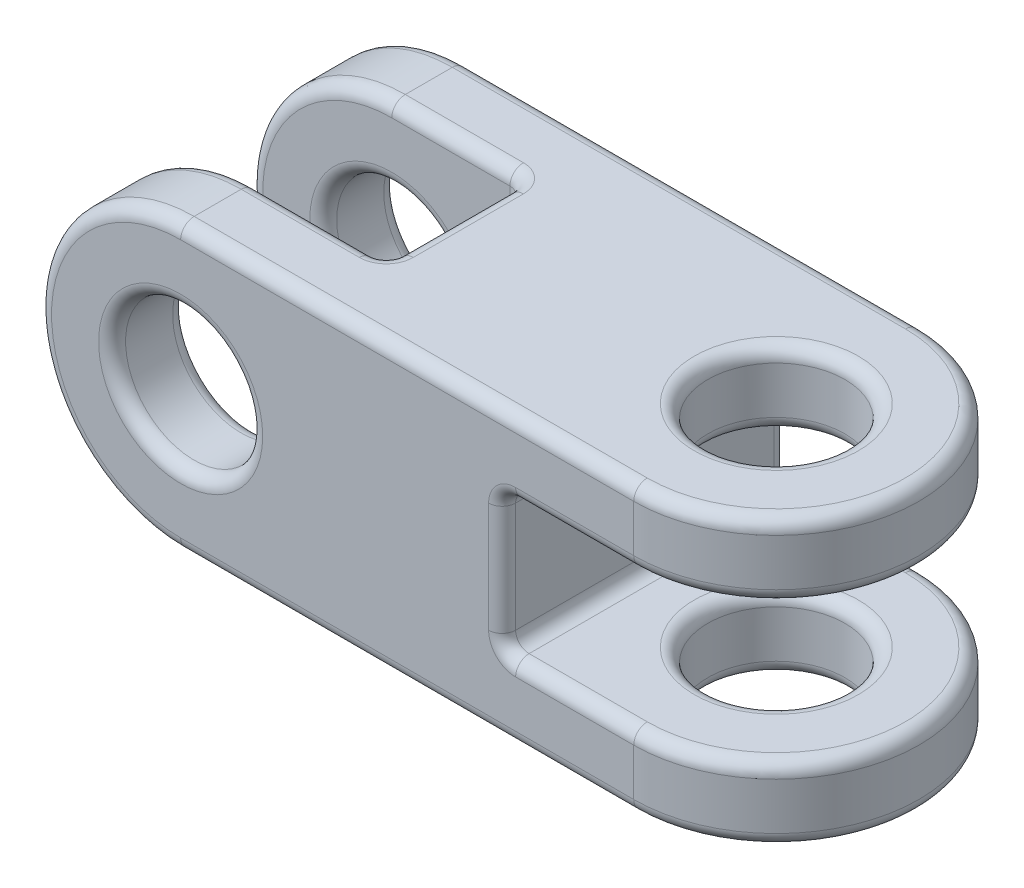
from build123d import *

# Parameters (mm, degrees)
SKETCH1_R               = 4.1275
EXTRUDE1_DEPTH          = 8.5852
SKETCH4_W               = 16.51
SKETCH4_H               = 8.255
CUT_EXTRUDE2_DEPTH      = 24.549361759
SKETCH5_R               = 4.1275
EXTRUDE2_DEPTH          = 8.5852
CUT_EXTRUDE4_DEPTH      = 39.490278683
CUT_EXTRUDE4_DEPTH_BACK = 39.490278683
SKETCH7_W               = 16.51
SKETCH7_H               = 8.255
FILLET4_R               = 0.8128


with BuildPart() as part:
    # Sketch1 → Extrude1 (new, symmetric)
    with BuildSketch(Plane.XY):
        with BuildLine():
            Line((0, -8.5852), (13.6398, -8.5852))
            Line((13.6398, -8.5852), (13.6398, 8.5852))
            Line((13.6398, 8.5852), (0, 8.5852))
            ThreePointArc((0, 8.5852), (-8.5852, 0), (0, -8.5852))
        make_face()
        Circle(SKETCH1_R, mode=Mode.SUBTRACT)
    extrude(amount=EXTRUDE1_DEPTH, both=True)

    # Sketch4 → Cut-Extrude2 (cut, through all)
    with BuildSketch(Plane(origin=(0, 8.5852, 0), x_dir=(-1, 0, 0), z_dir=(0, 1, 0))):
        with Locations((0.3302, 0)):
            Rectangle(SKETCH4_W, SKETCH4_H)
    extrude(amount=-CUT_EXTRUDE2_DEPTH, mode=Mode.SUBTRACT)

    # Sketch5 → Extrude2 (add, symmetric)
    with BuildSketch(Plane(origin=(27.2796, 0, 0), x_dir=(-1, 0, 0), z_dir=(0, -1, 0))):
        with BuildLine():
            Line((0, -8.5852), (13.6398, -8.5852))
            Line((13.6398, -8.5852), (13.6398, 8.5852))
            Line((13.6398, 8.5852), (0, 8.5852))
            ThreePointArc((0, 8.5852), (-8.5852, 0), (0, -8.5852))
        make_face()
        with Locations(Location((0, 0, 0), (0, 0, 90))):
            Circle(SKETCH5_R, mode=Mode.SUBTRACT)
    extrude(amount=EXTRUDE2_DEPTH, both=True)

    # Sketch7 → Cut-Extrude4 (cut, two sides: drawn at the far end of the back side and taken through both)
    with BuildSketch(Plane(origin=(27.94, 0, 0), x_dir=(-1, 0, 0), z_dir=(0, 0, -1)).offset(-CUT_EXTRUDE4_DEPTH_BACK)):
        with Locations((0.3302, 0)):
            Rectangle(SKETCH7_W, SKETCH7_H)
    extrude(amount=CUT_EXTRUDE4_DEPTH + CUT_EXTRUDE4_DEPTH_BACK, mode=Mode.SUBTRACT)

    # Fillet4
    fillet4_edges = [part.edges().sort_by_distance(p)[0] for p in [
        (-4.1275, 0, -8.5852),
        (-4.1275, 0, 8.5852),
        (13.6398, 8.5852, 8.5852),
        (3.9624, 8.5852, 4.1275),
        (7.9248, 8.5852, 0),
        (3.9624, 8.5852, -4.1275),
        (-8.5852, 0, -4.1275),
        (3.9624, -8.5852, -4.1275),
        (-4.1275, 0, -4.1275),
        (-8.5852, 0, 4.1275),
        (3.9624, -8.5852, 4.1275),
        (7.9248, 0, 4.1275),
        (-4.1275, 0, 4.1275),
        (7.9248, -8.5852, 0),
        (7.9248, 0, -4.1275),
        (-8.5852, 0, 8.5852),
        (13.6398, 8.5852, -8.5852),
        (35.8648, 8.5852, 0),
        (27.2796, 8.5852, 4.1275),
        (35.8648, -8.5852, 0),
        (27.2796, -8.5852, 4.1275),
        (13.6398, -8.5852, -8.5852),
        (-8.5852, 0, -8.5852),
        (23.3172, -4.1275, -8.5852),
        (19.3548, 0, -8.5852),
        (23.3172, 4.1275, -8.5852),
        (35.8648, -4.1275, 0),
        (23.3172, -4.1275, 8.5852),
        (19.3548, -4.1275, 0),
        (27.2796, -4.1275, 4.1275),
        (35.8648, 4.1275, 0),
        (23.3172, 4.1275, 8.5852),
        (27.2796, 4.1275, 4.1275),
        (19.3548, 4.1275, 0),
        (19.3548, 0, 8.5852),
        (13.6398, -8.5852, 8.5852),
    ]]
    fillet(fillet4_edges, radius=FILLET4_R)


solid = part.part
